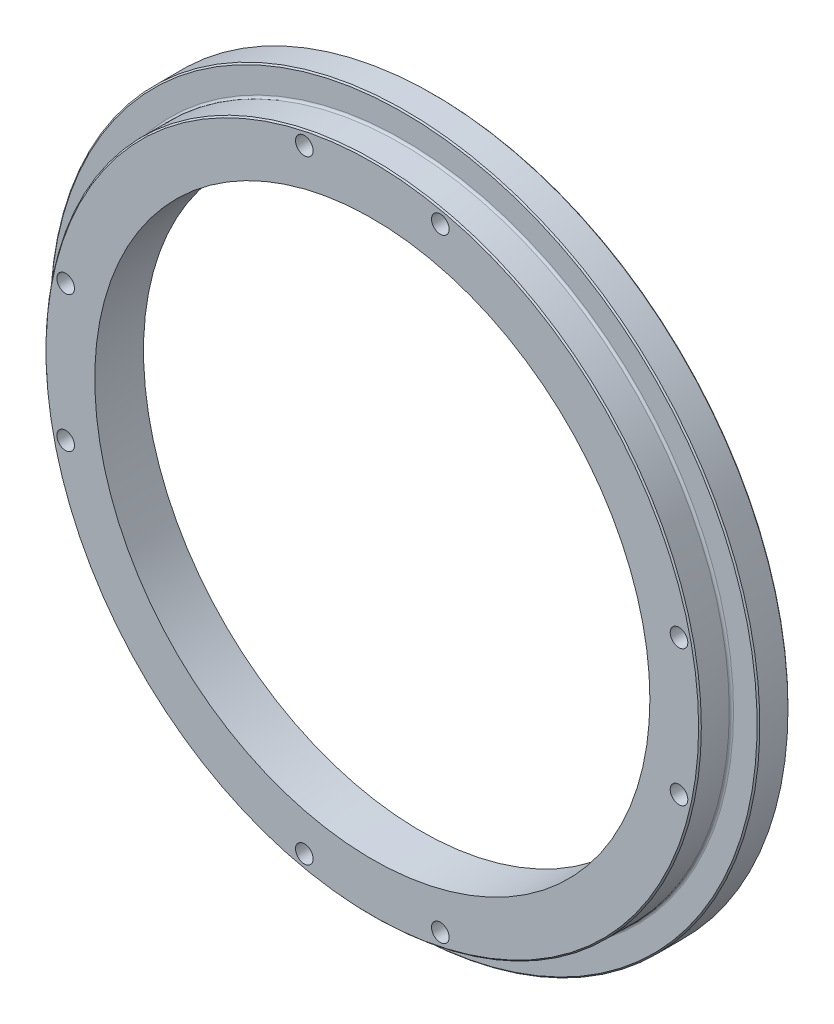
from build123d import *

# Parameters (mm, degrees)
ESQUISSE1_R                  = 121
ESQUISSE1_R_2                = 102.5
EXTRUSION1_DEPTH             = 23
ESQUISSE2_R                  = 3.25
EXTRUSION2_DEPTH             = 173.658622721
R_P_TITION_CIRCULAIRE1_COUNT = 4
ESQUISSE3_R                  = 109.75
ESQUISSE3_R_2                = 102.5
EXTRUSION4_DEPTH             = 5
ESQUISSE4_R                  = 131
ESQUISSE4_R_2                = 121
EXTRUSION5_DEPTH             = 11.4
CONG_1_R                     = 0.8
CHANFREIN1_SIZE              = 0.5


with BuildPart() as part:
    # Esquisse1 → Extrusion1 (new body)
    with BuildSketch(Plane.XY):
        Circle(ESQUISSE1_R)
        Circle(ESQUISSE1_R_2, mode=Mode.SUBTRACT)
    extrude(amount=EXTRUSION1_DEPTH)

    # Esquisse2 → Extrusion2 (cut, through all)
    with BuildSketch(Plane.XY.offset(23)):
        with Locations((-25.106995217, 113.250336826)):
            Circle(ESQUISSE2_R)
        with Locations(Location((25.106995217, 113.250336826, 0), (0, 0, 180))):
            Circle(ESQUISSE2_R)
    extrusion2 = extrude(amount=-EXTRUSION2_DEPTH, mode=Mode.SUBTRACT)

    # R_p_tition circulaire1: Extrusion2 ×4 about axis
    r_p_tition_circulaire1_axis = Axis((0, 0, 0), (0, 0, 1))
    for i in range(1, R_P_TITION_CIRCULAIRE1_COUNT):
        add(extrusion2.rotate(r_p_tition_circulaire1_axis, i * 360 / R_P_TITION_CIRCULAIRE1_COUNT), mode=Mode.SUBTRACT)

    # Esquisse3 → Extrusion4 (cut)
    with BuildSketch(Plane.XY):
        Circle(ESQUISSE3_R)
        Circle(ESQUISSE3_R_2, mode=Mode.SUBTRACT)
    extrude(amount=EXTRUSION4_DEPTH, mode=Mode.SUBTRACT)

    # Esquisse4 → Extrusion5 (add)
    with BuildSketch(Plane(origin=(0, 0, 0), x_dir=(-1, 0, 0), z_dir=(0, 0, -1))):
        Circle(ESQUISSE4_R)
        Circle(ESQUISSE4_R_2, mode=Mode.SUBTRACT)
    extrude(amount=-EXTRUSION5_DEPTH)

    # Cong_1
    cong_1_edges = [part.edges().sort_by_distance(p)[0] for p in [
        (-121, 0, 11.4),
    ]]
    fillet(cong_1_edges, radius=CONG_1_R)

    # Chanfrein1
    chanfrein1_edges = [part.edges().sort_by_distance(p)[0] for p in [
        (-121, 0, 23),
        (131, 0, 11.4),
        (131, 0, 0),
    ]]
    chamfer(chanfrein1_edges, length=CHANFREIN1_SIZE)


solid = part.part
